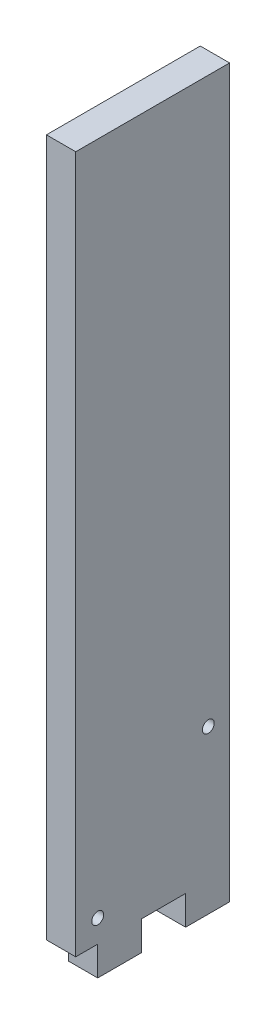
ISO-10303-21;
HEADER;
FILE_DESCRIPTION(('STEP AP214'),'2;1');
FILE_NAME('part.step','',(''),(''),'','','');
FILE_SCHEMA(('AUTOMOTIVE_DESIGN { 1 0 10303 214 1 1 1 1 }'));
ENDSEC;
DATA;
#1=APPLICATION_CONTEXT('core data for automotive mechanical design processes');
#2=APPLICATION_PROTOCOL_DEFINITION('international standard','automotive_design',2000,#1);
#3=PRODUCT_CONTEXT('',#1,'mechanical');
#4=PRODUCT('Part','Part','',(#3));
#5=PRODUCT_RELATED_PRODUCT_CATEGORY('part','',(#4));
#6=PRODUCT_DEFINITION_FORMATION('','',#4);
#7=PRODUCT_DEFINITION_CONTEXT('part definition',#1,'design');
#8=PRODUCT_DEFINITION('design','',#6,#7);
#9=PRODUCT_DEFINITION_SHAPE('','',#8);
#10=(LENGTH_UNIT() NAMED_UNIT(*) SI_UNIT(.MILLI.,.METRE.));
#11=(NAMED_UNIT(*) PLANE_ANGLE_UNIT() SI_UNIT($,.RADIAN.));
#12=(NAMED_UNIT(*) SI_UNIT($,.STERADIAN.) SOLID_ANGLE_UNIT());
#13=UNCERTAINTY_MEASURE_WITH_UNIT(LENGTH_MEASURE(1.E-05),#10,'distance_accuracy_value','');
#14=(GEOMETRIC_REPRESENTATION_CONTEXT(3) GLOBAL_UNCERTAINTY_ASSIGNED_CONTEXT((#13)) GLOBAL_UNIT_ASSIGNED_CONTEXT((#10,
#11,#12)) REPRESENTATION_CONTEXT('',''));
#15=CARTESIAN_POINT('',(0.,0.,0.));
#16=DIRECTION('',(0.,0.,1.));
#17=DIRECTION('',(1.,0.,0.));
#18=AXIS2_PLACEMENT_3D('',#15,#16,#17);
#19=CARTESIAN_POINT('',(20.,0.,0.));
#20=DIRECTION('',(1.,0.,0.));
#21=DIRECTION('',(0.,0.,-1.));
#22=AXIS2_PLACEMENT_3D('',#19,#20,#21);
#23=PLANE('',#22);
#24=CARTESIAN_POINT('',(20.,15.421190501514,-15.0000000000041));
#25=DIRECTION('',(1.,0.,0.));
#26=DIRECTION('',(0.,0.,-1.));
#27=AXIS2_PLACEMENT_3D('',#24,#25,#26);
#28=CIRCLE('',#27,4.05000000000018);
#29=CARTESIAN_POINT('',(20.,15.421190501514,-19.0500000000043));
#30=VERTEX_POINT('',#29);
#31=EDGE_CURVE('E145',#30,#30,#28,.T.);
#32=ORIENTED_EDGE('',*,*,#31,.F.);
#33=EDGE_LOOP('',(#32));
#34=FACE_BOUND('',#33,.T.);
#35=DIRECTION('',(0.,-1.,0.));
#36=VECTOR('',#35,1.);
#37=CARTESIAN_POINT('',(20.,0.,-15.0000000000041));
#38=LINE('',#37,#36);
#39=CARTESIAN_POINT('',(20.,0.,-15.0000000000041));
#40=VERTEX_POINT('',#39);
#41=CARTESIAN_POINT('',(20.,-20.,-15.0000000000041));
#42=VERTEX_POINT('',#41);
#43=EDGE_CURVE('E161',#40,#42,#38,.T.);
#44=ORIENTED_EDGE('',*,*,#43,.T.);
#45=DIRECTION('',(0.,0.,-1.));
#46=VECTOR('',#45,1.);
#47=CARTESIAN_POINT('',(20.,-20.,-15.0000000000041));
#48=LINE('',#47,#46);
#49=CARTESIAN_POINT('',(20.,-20.,-45.0000000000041));
#50=VERTEX_POINT('',#49);
#51=EDGE_CURVE('E98',#42,#50,#48,.T.);
#52=ORIENTED_EDGE('',*,*,#51,.T.);
#53=DIRECTION('',(0.,1.,0.));
#54=VECTOR('',#53,1.);
#55=CARTESIAN_POINT('',(20.,-20.,-45.0000000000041));
#56=LINE('',#55,#54);
#57=CARTESIAN_POINT('',(20.,0.,-45.0000000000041));
#58=VERTEX_POINT('',#57);
#59=EDGE_CURVE('E182',#50,#58,#56,.T.);
#60=ORIENTED_EDGE('',*,*,#59,.T.);
#61=DIRECTION('',(0.,0.,-1.));
#62=VECTOR('',#61,1.);
#63=CARTESIAN_POINT('',(20.,0.,-45.0000000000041));
#64=LINE('',#63,#62);
#65=CARTESIAN_POINT('',(20.,0.,-75.0000000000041));
#66=VERTEX_POINT('',#65);
#67=EDGE_CURVE('E201',#58,#66,#64,.T.);
#68=ORIENTED_EDGE('',*,*,#67,.T.);
#69=DIRECTION('',(0.,-1.,0.));
#70=VECTOR('',#69,1.);
#71=CARTESIAN_POINT('',(20.,0.,-75.0000000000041));
#72=LINE('',#71,#70);
#73=CARTESIAN_POINT('',(20.,-20.,-75.0000000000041));
#74=VERTEX_POINT('',#73);
#75=EDGE_CURVE('E198',#66,#74,#72,.T.);
#76=ORIENTED_EDGE('',*,*,#75,.T.);
#77=DIRECTION('',(0.,0.,-1.));
#78=VECTOR('',#77,1.);
#79=CARTESIAN_POINT('',(20.,-20.,-75.0000000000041));
#80=LINE('',#79,#78);
#81=CARTESIAN_POINT('',(20.,-20.,-105.000000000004));
#82=VERTEX_POINT('',#81);
#83=EDGE_CURVE('E200',#74,#82,#80,.T.);
#84=ORIENTED_EDGE('',*,*,#83,.T.);
#85=DIRECTION('',(0.,1.,0.));
#86=VECTOR('',#85,1.);
#87=CARTESIAN_POINT('',(20.,-20.,-105.000000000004));
#88=LINE('',#87,#86);
#89=CARTESIAN_POINT('',(20.,475.917508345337,-105.000000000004));
#90=VERTEX_POINT('',#89);
#91=EDGE_CURVE('E123',#82,#90,#88,.T.);
#92=ORIENTED_EDGE('',*,*,#91,.T.);
#93=DIRECTION('',(0.,0.,1.));
#94=VECTOR('',#93,1.);
#95=CARTESIAN_POINT('',(20.,475.917508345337,0.));
#96=LINE('',#95,#94);
#97=CARTESIAN_POINT('',(20.,475.917508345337,0.));
#98=VERTEX_POINT('',#97);
#99=EDGE_CURVE('E117',#90,#98,#96,.T.);
#100=ORIENTED_EDGE('',*,*,#99,.T.);
#101=DIRECTION('',(0.,-1.,0.));
#102=VECTOR('',#101,1.);
#103=CARTESIAN_POINT('',(20.,0.,0.));
#104=LINE('',#103,#102);
#105=CARTESIAN_POINT('',(20.,0.,0.));
#106=VERTEX_POINT('',#105);
#107=EDGE_CURVE('E121',#98,#106,#104,.T.);
#108=ORIENTED_EDGE('',*,*,#107,.T.);
#109=DIRECTION('',(0.,0.,-1.));
#110=VECTOR('',#109,1.);
#111=CARTESIAN_POINT('',(20.,0.,0.));
#112=LINE('',#111,#110);
#113=EDGE_CURVE('E49',#106,#40,#112,.T.);
#114=ORIENTED_EDGE('',*,*,#113,.T.);
#115=EDGE_LOOP('',(#44,#52,#60,#68,#76,#84,#92,#100,#108,#114));
#116=FACE_BOUND('',#115,.T.);
#117=CARTESIAN_POINT('',(20.,90.9175083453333,-90.4963178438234));
#118=DIRECTION('',(1.,0.,0.));
#119=DIRECTION('',(0.,0.,-1.));
#120=AXIS2_PLACEMENT_3D('',#117,#118,#119);
#121=CIRCLE('',#120,4.04999999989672);
#122=CARTESIAN_POINT('',(20.,90.9175083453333,-94.5463178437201));
#123=VERTEX_POINT('',#122);
#124=EDGE_CURVE('E212',#123,#123,#121,.T.);
#125=ORIENTED_EDGE('',*,*,#124,.F.);
#126=EDGE_LOOP('',(#125));
#127=FACE_BOUND('',#126,.T.);
#128=ADVANCED_FACE('F32',(#34,#116,#127),#23,.T.);
#129=CARTESIAN_POINT('',(0.,0.,0.));
#130=DIRECTION('',(1.,0.,0.));
#131=DIRECTION('',(0.,0.,-1.));
#132=AXIS2_PLACEMENT_3D('',#129,#130,#131);
#133=PLANE('',#132);
#134=CARTESIAN_POINT('',(0.,15.421190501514,-15.0000000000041));
#135=DIRECTION('',(1.,0.,0.));
#136=DIRECTION('',(0.,0.,-1.));
#137=AXIS2_PLACEMENT_3D('',#134,#135,#136);
#138=CIRCLE('',#137,4.05000000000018);
#139=CARTESIAN_POINT('',(0.,15.421190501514,-19.0500000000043));
#140=VERTEX_POINT('',#139);
#141=EDGE_CURVE('E209',#140,#140,#138,.T.);
#142=ORIENTED_EDGE('',*,*,#141,.T.);
#143=EDGE_LOOP('',(#142));
#144=FACE_BOUND('',#143,.T.);
#145=DIRECTION('',(0.,-1.,0.));
#146=VECTOR('',#145,1.);
#147=CARTESIAN_POINT('',(0.,0.,-15.0000000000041));
#148=LINE('',#147,#146);
#149=CARTESIAN_POINT('',(0.,0.,-15.0000000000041));
#150=VERTEX_POINT('',#149);
#151=CARTESIAN_POINT('',(0.,-20.,-15.0000000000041));
#152=VERTEX_POINT('',#151);
#153=EDGE_CURVE('E141',#150,#152,#148,.T.);
#154=ORIENTED_EDGE('',*,*,#153,.F.);
#155=DIRECTION('',(0.,0.,-1.));
#156=VECTOR('',#155,1.);
#157=CARTESIAN_POINT('',(0.,0.,0.));
#158=LINE('',#157,#156);
#159=CARTESIAN_POINT('',(0.,0.,0.));
#160=VERTEX_POINT('',#159);
#161=EDGE_CURVE('E90',#160,#150,#158,.T.);
#162=ORIENTED_EDGE('',*,*,#161,.F.);
#163=DIRECTION('',(0.,-1.,0.));
#164=VECTOR('',#163,1.);
#165=CARTESIAN_POINT('',(0.,0.,0.));
#166=LINE('',#165,#164);
#167=CARTESIAN_POINT('',(0.,475.917508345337,0.));
#168=VERTEX_POINT('',#167);
#169=EDGE_CURVE('E84',#168,#160,#166,.T.);
#170=ORIENTED_EDGE('',*,*,#169,.F.);
#171=DIRECTION('',(0.,0.,1.));
#172=VECTOR('',#171,1.);
#173=CARTESIAN_POINT('',(0.,475.917508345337,0.));
#174=LINE('',#173,#172);
#175=CARTESIAN_POINT('',(0.,475.917508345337,-105.000000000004));
#176=VERTEX_POINT('',#175);
#177=EDGE_CURVE('E131',#176,#168,#174,.T.);
#178=ORIENTED_EDGE('',*,*,#177,.F.);
#179=DIRECTION('',(0.,1.,0.));
#180=VECTOR('',#179,1.);
#181=CARTESIAN_POINT('',(0.,0.,-105.000000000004));
#182=LINE('',#181,#180);
#183=CARTESIAN_POINT('',(0.,-20.,-105.000000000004));
#184=VERTEX_POINT('',#183);
#185=EDGE_CURVE('E156',#184,#176,#182,.T.);
#186=ORIENTED_EDGE('',*,*,#185,.F.);
#187=DIRECTION('',(0.,0.,-1.));
#188=VECTOR('',#187,1.);
#189=CARTESIAN_POINT('',(0.,-20.,-75.0000000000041));
#190=LINE('',#189,#188);
#191=CARTESIAN_POINT('',(0.,-20.,-75.0000000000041));
#192=VERTEX_POINT('',#191);
#193=EDGE_CURVE('E153',#192,#184,#190,.T.);
#194=ORIENTED_EDGE('',*,*,#193,.F.);
#195=DIRECTION('',(0.,-1.,0.));
#196=VECTOR('',#195,1.);
#197=CARTESIAN_POINT('',(0.,0.,-75.0000000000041));
#198=LINE('',#197,#196);
#199=CARTESIAN_POINT('',(0.,0.,-75.0000000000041));
#200=VERTEX_POINT('',#199);
#201=EDGE_CURVE('E151',#200,#192,#198,.T.);
#202=ORIENTED_EDGE('',*,*,#201,.F.);
#203=DIRECTION('',(0.,0.,-1.));
#204=VECTOR('',#203,1.);
#205=CARTESIAN_POINT('',(0.,0.,-45.0000000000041));
#206=LINE('',#205,#204);
#207=CARTESIAN_POINT('',(0.,0.,-45.0000000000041));
#208=VERTEX_POINT('',#207);
#209=EDGE_CURVE('E149',#208,#200,#206,.T.);
#210=ORIENTED_EDGE('',*,*,#209,.F.);
#211=DIRECTION('',(0.,1.,0.));
#212=VECTOR('',#211,1.);
#213=CARTESIAN_POINT('',(0.,-20.,-45.0000000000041));
#214=LINE('',#213,#212);
#215=CARTESIAN_POINT('',(0.,-20.,-45.0000000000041));
#216=VERTEX_POINT('',#215);
#217=EDGE_CURVE('E147',#216,#208,#214,.T.);
#218=ORIENTED_EDGE('',*,*,#217,.F.);
#219=DIRECTION('',(0.,0.,-1.));
#220=VECTOR('',#219,1.);
#221=CARTESIAN_POINT('',(0.,-20.,-15.0000000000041));
#222=LINE('',#221,#220);
#223=EDGE_CURVE('E144',#152,#216,#222,.T.);
#224=ORIENTED_EDGE('',*,*,#223,.F.);
#225=EDGE_LOOP('',(#154,#162,#170,#178,#186,#194,#202,#210,#218,#224));
#226=FACE_BOUND('',#225,.T.);
#227=CARTESIAN_POINT('',(0.,90.9175083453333,-90.4963178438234));
#228=DIRECTION('',(1.,0.,0.));
#229=DIRECTION('',(0.,0.,-1.));
#230=AXIS2_PLACEMENT_3D('',#227,#228,#229);
#231=CIRCLE('',#230,4.04999999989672);
#232=CARTESIAN_POINT('',(0.,90.9175083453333,-94.5463178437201));
#233=VERTEX_POINT('',#232);
#234=EDGE_CURVE('E215',#233,#233,#231,.T.);
#235=ORIENTED_EDGE('',*,*,#234,.T.);
#236=EDGE_LOOP('',(#235));
#237=FACE_BOUND('',#236,.T.);
#238=ADVANCED_FACE('F186',(#144,#226,#237),#133,.F.);
#239=CARTESIAN_POINT('',(20.,0.,-15.0000000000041));
#240=DIRECTION('',(0.,0.,-1.));
#241=DIRECTION('',(0.,1.,0.));
#242=AXIS2_PLACEMENT_3D('',#239,#240,#241);
#243=PLANE('',#242);
#244=ORIENTED_EDGE('',*,*,#153,.T.);
#245=DIRECTION('',(-1.,0.,0.));
#246=VECTOR('',#245,1.);
#247=CARTESIAN_POINT('',(20.,-20.,-15.0000000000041));
#248=LINE('',#247,#246);
#249=EDGE_CURVE('E11',#42,#152,#248,.T.);
#250=ORIENTED_EDGE('',*,*,#249,.F.);
#251=ORIENTED_EDGE('',*,*,#43,.F.);
#252=DIRECTION('',(-1.,0.,0.));
#253=VECTOR('',#252,1.);
#254=CARTESIAN_POINT('',(20.,0.,-15.0000000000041));
#255=LINE('',#254,#253);
#256=EDGE_CURVE('E137',#40,#150,#255,.T.);
#257=ORIENTED_EDGE('',*,*,#256,.T.);
#258=EDGE_LOOP('',(#244,#250,#251,#257));
#259=FACE_BOUND('',#258,.T.);
#260=ADVANCED_FACE('F34',(#259),#243,.F.);
#261=CARTESIAN_POINT('',(20.,-20.,-15.0000000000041));
#262=DIRECTION('',(0.,1.,0.));
#263=DIRECTION('',(0.,0.,1.));
#264=AXIS2_PLACEMENT_3D('',#261,#262,#263);
#265=PLANE('',#264);
#266=ORIENTED_EDGE('',*,*,#223,.T.);
#267=DIRECTION('',(-1.,0.,0.));
#268=VECTOR('',#267,1.);
#269=CARTESIAN_POINT('',(20.,-20.,-45.0000000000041));
#270=LINE('',#269,#268);
#271=EDGE_CURVE('E41',#50,#216,#270,.T.);
#272=ORIENTED_EDGE('',*,*,#271,.F.);
#273=ORIENTED_EDGE('',*,*,#51,.F.);
#274=ORIENTED_EDGE('',*,*,#249,.T.);
#275=EDGE_LOOP('',(#266,#272,#273,#274));
#276=FACE_BOUND('',#275,.T.);
#277=ADVANCED_FACE('F256',(#276),#265,.F.);
#278=CARTESIAN_POINT('',(20.,-20.,-45.0000000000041));
#279=DIRECTION('',(0.,0.,1.));
#280=DIRECTION('',(1.,0.,0.));
#281=AXIS2_PLACEMENT_3D('',#278,#279,#280);
#282=PLANE('',#281);
#283=ORIENTED_EDGE('',*,*,#217,.T.);
#284=DIRECTION('',(-1.,0.,0.));
#285=VECTOR('',#284,1.);
#286=CARTESIAN_POINT('',(20.,0.,-45.0000000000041));
#287=LINE('',#286,#285);
#288=EDGE_CURVE('E174',#58,#208,#287,.T.);
#289=ORIENTED_EDGE('',*,*,#288,.F.);
#290=ORIENTED_EDGE('',*,*,#59,.F.);
#291=ORIENTED_EDGE('',*,*,#271,.T.);
#292=EDGE_LOOP('',(#283,#289,#290,#291));
#293=FACE_BOUND('',#292,.T.);
#294=ADVANCED_FACE('F180',(#293),#282,.F.);
#295=CARTESIAN_POINT('',(20.,0.,-45.0000000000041));
#296=DIRECTION('',(0.,1.,0.));
#297=DIRECTION('',(0.,0.,1.));
#298=AXIS2_PLACEMENT_3D('',#295,#296,#297);
#299=PLANE('',#298);
#300=ORIENTED_EDGE('',*,*,#209,.T.);
#301=DIRECTION('',(-1.,0.,0.));
#302=VECTOR('',#301,1.);
#303=CARTESIAN_POINT('',(20.,0.,-75.0000000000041));
#304=LINE('',#303,#302);
#305=EDGE_CURVE('E171',#66,#200,#304,.T.);
#306=ORIENTED_EDGE('',*,*,#305,.F.);
#307=ORIENTED_EDGE('',*,*,#67,.F.);
#308=ORIENTED_EDGE('',*,*,#288,.T.);
#309=EDGE_LOOP('',(#300,#306,#307,#308));
#310=FACE_BOUND('',#309,.T.);
#311=ADVANCED_FACE('F192',(#310),#299,.F.);
#312=CARTESIAN_POINT('',(20.,0.,-75.0000000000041));
#313=DIRECTION('',(0.,0.,-1.));
#314=DIRECTION('',(-1.,0.,0.));
#315=AXIS2_PLACEMENT_3D('',#312,#313,#314);
#316=PLANE('',#315);
#317=ORIENTED_EDGE('',*,*,#201,.T.);
#318=DIRECTION('',(-1.,0.,0.));
#319=VECTOR('',#318,1.);
#320=CARTESIAN_POINT('',(20.,-20.,-75.0000000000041));
#321=LINE('',#320,#319);
#322=EDGE_CURVE('E168',#74,#192,#321,.T.);
#323=ORIENTED_EDGE('',*,*,#322,.F.);
#324=ORIENTED_EDGE('',*,*,#75,.F.);
#325=ORIENTED_EDGE('',*,*,#305,.T.);
#326=EDGE_LOOP('',(#317,#323,#324,#325));
#327=FACE_BOUND('',#326,.T.);
#328=ADVANCED_FACE('F196',(#327),#316,.F.);
#329=CARTESIAN_POINT('',(20.,-20.,-75.0000000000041));
#330=DIRECTION('',(0.,1.,0.));
#331=DIRECTION('',(0.,0.,1.));
#332=AXIS2_PLACEMENT_3D('',#329,#330,#331);
#333=PLANE('',#332);
#334=ORIENTED_EDGE('',*,*,#193,.T.);
#335=DIRECTION('',(-1.,0.,0.));
#336=VECTOR('',#335,1.);
#337=CARTESIAN_POINT('',(20.,-20.,-105.000000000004));
#338=LINE('',#337,#336);
#339=EDGE_CURVE('E165',#82,#184,#338,.T.);
#340=ORIENTED_EDGE('',*,*,#339,.F.);
#341=ORIENTED_EDGE('',*,*,#83,.F.);
#342=ORIENTED_EDGE('',*,*,#322,.T.);
#343=EDGE_LOOP('',(#334,#340,#341,#342));
#344=FACE_BOUND('',#343,.T.);
#345=ADVANCED_FACE('F246',(#344),#333,.F.);
#346=CARTESIAN_POINT('',(20.,0.,-105.000000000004));
#347=DIRECTION('',(0.,0.,1.));
#348=DIRECTION('',(1.,0.,0.));
#349=AXIS2_PLACEMENT_3D('',#346,#347,#348);
#350=PLANE('',#349);
#351=ORIENTED_EDGE('',*,*,#185,.T.);
#352=DIRECTION('',(-1.,0.,0.));
#353=VECTOR('',#352,1.);
#354=CARTESIAN_POINT('',(20.,475.917508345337,-105.000000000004));
#355=LINE('',#354,#353);
#356=EDGE_CURVE('E132',#90,#176,#355,.T.);
#357=ORIENTED_EDGE('',*,*,#356,.F.);
#358=ORIENTED_EDGE('',*,*,#91,.F.);
#359=ORIENTED_EDGE('',*,*,#339,.T.);
#360=EDGE_LOOP('',(#351,#357,#358,#359));
#361=FACE_BOUND('',#360,.T.);
#362=ADVANCED_FACE('F243',(#361),#350,.F.);
#363=CARTESIAN_POINT('',(20.,475.917508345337,0.));
#364=DIRECTION('',(0.,-1.,0.));
#365=DIRECTION('',(0.,0.,-1.));
#366=AXIS2_PLACEMENT_3D('',#363,#364,#365);
#367=PLANE('',#366);
#368=ORIENTED_EDGE('',*,*,#177,.T.);
#369=DIRECTION('',(-1.,0.,0.));
#370=VECTOR('',#369,1.);
#371=CARTESIAN_POINT('',(20.,475.917508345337,0.));
#372=LINE('',#371,#370);
#373=EDGE_CURVE('E128',#98,#168,#372,.T.);
#374=ORIENTED_EDGE('',*,*,#373,.F.);
#375=ORIENTED_EDGE('',*,*,#99,.F.);
#376=ORIENTED_EDGE('',*,*,#356,.T.);
#377=EDGE_LOOP('',(#368,#374,#375,#376));
#378=FACE_BOUND('',#377,.T.);
#379=ADVANCED_FACE('F129',(#378),#367,.F.);
#380=CARTESIAN_POINT('',(20.,0.,0.));
#381=DIRECTION('',(0.,0.,-1.));
#382=DIRECTION('',(-1.,0.,0.));
#383=AXIS2_PLACEMENT_3D('',#380,#381,#382);
#384=PLANE('',#383);
#385=ORIENTED_EDGE('',*,*,#169,.T.);
#386=DIRECTION('',(-1.,0.,0.));
#387=VECTOR('',#386,1.);
#388=CARTESIAN_POINT('',(20.,0.,0.));
#389=LINE('',#388,#387);
#390=EDGE_CURVE('E133',#106,#160,#389,.T.);
#391=ORIENTED_EDGE('',*,*,#390,.F.);
#392=ORIENTED_EDGE('',*,*,#107,.F.);
#393=ORIENTED_EDGE('',*,*,#373,.T.);
#394=EDGE_LOOP('',(#385,#391,#392,#393));
#395=FACE_BOUND('',#394,.T.);
#396=ADVANCED_FACE('F135',(#395),#384,.F.);
#397=CARTESIAN_POINT('',(20.,0.,0.));
#398=DIRECTION('',(0.,1.,0.));
#399=DIRECTION('',(0.,0.,1.));
#400=AXIS2_PLACEMENT_3D('',#397,#398,#399);
#401=PLANE('',#400);
#402=ORIENTED_EDGE('',*,*,#161,.T.);
#403=ORIENTED_EDGE('',*,*,#256,.F.);
#404=ORIENTED_EDGE('',*,*,#113,.F.);
#405=ORIENTED_EDGE('',*,*,#390,.T.);
#406=EDGE_LOOP('',(#402,#403,#404,#405));
#407=FACE_BOUND('',#406,.T.);
#408=ADVANCED_FACE('F236',(#407),#401,.F.);
#409=CARTESIAN_POINT('',(20.,15.421190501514,-15.0000000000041));
#410=DIRECTION('',(-1.,0.,0.));
#411=DIRECTION('',(0.,0.,1.));
#412=AXIS2_PLACEMENT_3D('',#409,#410,#411);
#413=CYLINDRICAL_SURFACE('',#412,4.05000000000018);
#414=ORIENTED_EDGE('',*,*,#31,.T.);
#415=EDGE_LOOP('',(#414));
#416=FACE_BOUND('',#415,.T.);
#417=ORIENTED_EDGE('',*,*,#141,.F.);
#418=EDGE_LOOP('',(#417));
#419=FACE_BOUND('',#418,.T.);
#420=ADVANCED_FACE('F233',(#416,#419),#413,.F.);
#421=CARTESIAN_POINT('',(20.,90.9175083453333,-90.4963178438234));
#422=DIRECTION('',(-1.,0.,0.));
#423=DIRECTION('',(0.,0.,1.));
#424=AXIS2_PLACEMENT_3D('',#421,#422,#423);
#425=CYLINDRICAL_SURFACE('',#424,4.04999999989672);
#426=ORIENTED_EDGE('',*,*,#124,.T.);
#427=EDGE_LOOP('',(#426));
#428=FACE_BOUND('',#427,.T.);
#429=ORIENTED_EDGE('',*,*,#234,.F.);
#430=EDGE_LOOP('',(#429));
#431=FACE_BOUND('',#430,.T.);
#432=ADVANCED_FACE('F221',(#428,#431),#425,.F.);
#433=CLOSED_SHELL('',(#128,#238,#260,#277,#294,#311,#328,#345,#362,#379,#396,#408,#420,#432));
#434=MANIFOLD_SOLID_BREP('B2',#433);
#435=ADVANCED_BREP_SHAPE_REPRESENTATION('',(#18,#434),#14);
#436=SHAPE_DEFINITION_REPRESENTATION(#9,#435);
ENDSEC;
END-ISO-10303-21;
